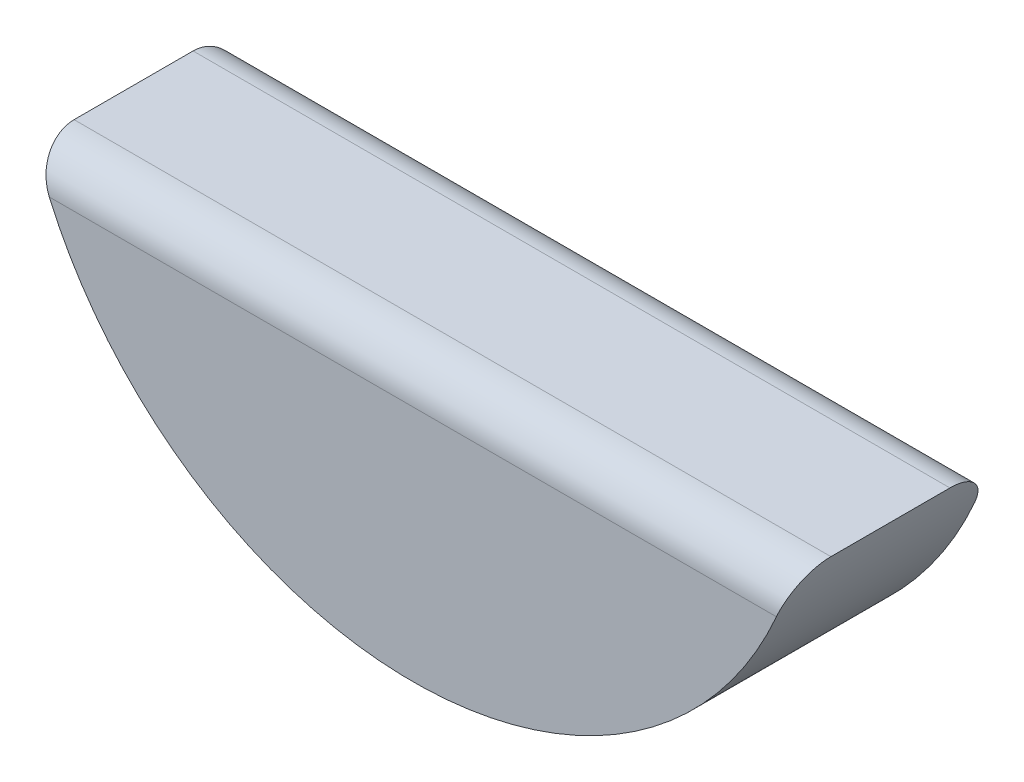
from build123d import *

# Parameters (mm, degrees)
EXTRUDE1_DEPTH = 0.5
FILLET1_R      = 0.2


with BuildPart() as part:
    # Sketch1 → Extrude1 (new, symmetric)
    with BuildSketch(Plane.XY):
        with BuildLine():
            Line((-1.907878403, 0), (1.907878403, 0))
            ThreePointArc((1.907878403, 0), (0, -1.4), (-1.907878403, 0))
        make_face()
    extrude(amount=EXTRUDE1_DEPTH, both=True)

    # Fillet1
    fillet1_edges = [part.edges().sort_by_distance(p)[0] for p in [
        (0, 0, -0.5),
        (0, 0, 0.5),
    ]]
    fillet(fillet1_edges, radius=FILLET1_R)


solid = part.part
